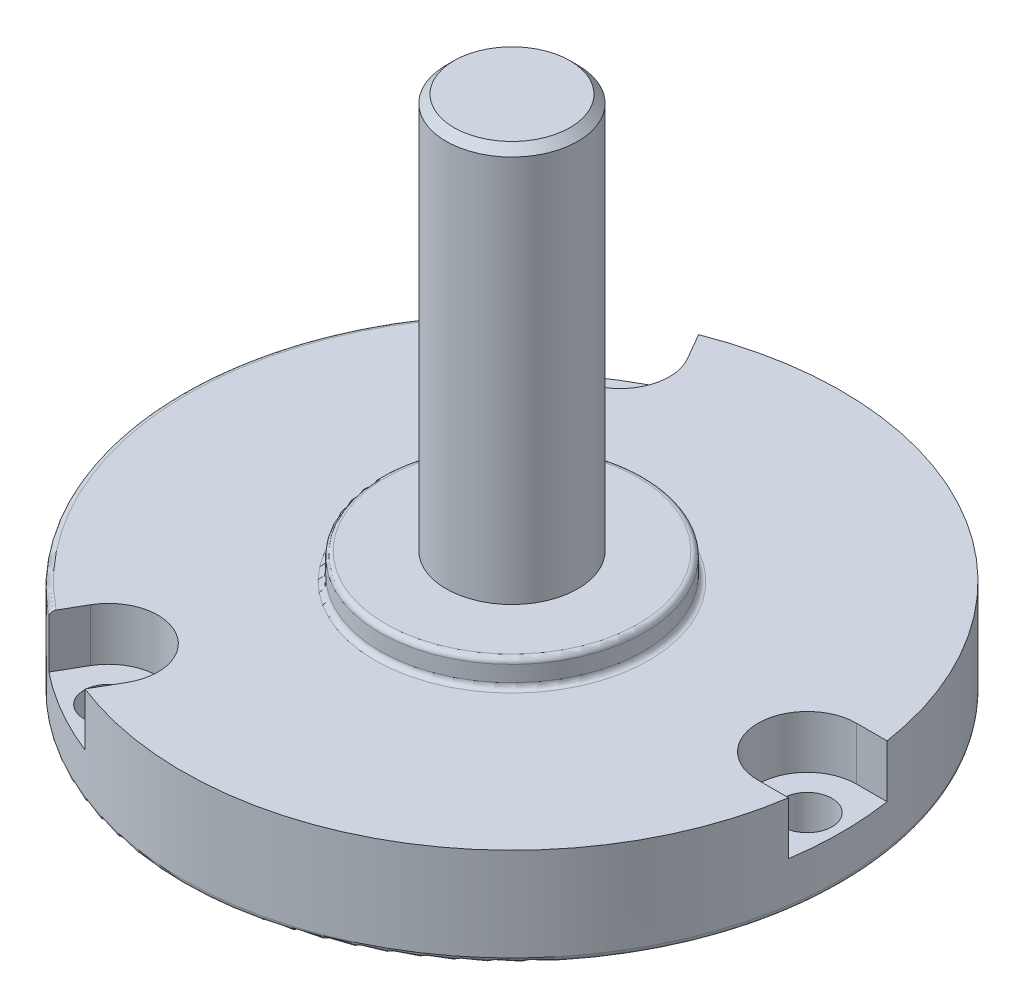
from build123d import *

# Parameters (mm, degrees)
SKETCH1_R          = 15.875
EXTRUDE1_DEPTH     = 4.7498
SKETCH2_R          = 6.35
EXTRUDE2_DEPTH     = 1.27
SKETCH3_R          = 11.684
CUT_EXTRUDE1_DEPTH = 0.762
CUT_EXTRUDE2_START = -2.54
CUT_EXTRUDE2_DEPTH = 2.54
CIRPATTERN1_COUNT  = 3
SKETCH19_R         = 3.175
EXTRUDE5_DEPTH     = 19.05
CHAMFER6_SIZE      = 0.381
FILLET1_R          = 0.254
FILLET2_R          = 0.254


with BuildPart() as part:
    # Sketch1 → Extrude1 (new body)
    with BuildSketch(Plane(origin=(0, 0, 0), x_dir=(1, 0, 0), z_dir=(0, 1, 0))):
        with Locations(Location((0, 0, 0), (0, 0, 270))):
            Circle(SKETCH1_R)
    extrude(amount=EXTRUDE1_DEPTH)

    # Sketch2 → Extrude2 (add)
    with BuildSketch(Plane(origin=(0, 4.7498, 0), x_dir=(-1, 0, 0), z_dir=(0, 1, 0))):
        with Locations(Location((0, 0, 0), (0, 0, 90))):
            Circle(SKETCH2_R)
    extrude(amount=EXTRUDE2_DEPTH)

    # Sketch3 → Cut-Extrude1 (cut)
    with BuildSketch(Plane.XZ):
        with Locations(Location((0, 0, 0), (0, 0, 270))):
            Circle(SKETCH3_R)
    extrude(amount=-CUT_EXTRUDE1_DEPTH, mode=Mode.SUBTRACT)

    # Sketch16 → 3_32 _0.09375_ Diameter Hole1 (revolve, cut)
    with BuildSketch(Plane(origin=(14.224, 0, 0), x_dir=(0, 0, -1), z_dir=(1, 0, 0))):
        Polygon((0, 0), (0, 7.065399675), (1.190625, 6.35), (1.190625, 0), align=None)
    f_3_32_0_09375_diameter_hole1 = revolve(axis=Axis((14.224, -6.35, 0), (0, 1, 0)), mode=Mode.SUBTRACT)

    # Sketch23 → Cut-Extrude2 (cut)
    with BuildSketch(Plane(origin=(0, 4.7498, 0), x_dir=(-1, 0, 0), z_dir=(0, 1, 0)).offset(CUT_EXTRUDE2_START)):
        with BuildLine():
            Line((-14.224, 2.3749), (-15.696352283, 2.3749))
            ThreePointArc((-15.696352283, 2.3749), (-15.875, 0), (-15.696352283, -2.3749))
            Line((-15.696352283, -2.3749), (-14.224, -2.3749))
            ThreePointArc((-14.224, -2.3749), (-11.8491, 0), (-14.224, 2.3749))
        make_face()
    cut_extrude2 = extrude(amount=CUT_EXTRUDE2_DEPTH, mode=Mode.SUBTRACT)

    # CirPattern1: 3_32 _0.09375_ Diameter Hole1, Cut-Extrude2 ×3 about axis
    cirpattern1_axis = Axis((0, 0, 0), (0, 1, 0))
    add([f_3_32_0_09375_diameter_hole1.rotate(cirpattern1_axis, i * 360 / CIRPATTERN1_COUNT) for i in range(1, CIRPATTERN1_COUNT)], mode=Mode.SUBTRACT)
    add([cut_extrude2.rotate(cirpattern1_axis, i * 360 / CIRPATTERN1_COUNT) for i in range(1, CIRPATTERN1_COUNT)], mode=Mode.SUBTRACT)

    # Sketch19 → Extrude5 (add)
    with BuildSketch(Plane(origin=(0, 6.0198, 0), x_dir=(-1, 0, 0), z_dir=(0, 1, 0))):
        with Locations(Location((0, 0, 0), (0, 0, 270))):
            Circle(SKETCH19_R)
    extrude(amount=EXTRUDE5_DEPTH)

    # Chamfer6
    chamfer6_edges = [part.edges().sort_by_distance(p)[0] for p in [
        (0, 25.0698, 3.175),
    ]]
    chamfer(chamfer6_edges, length=CHAMFER6_SIZE)

    # Fillet1
    fillet1_edges = [part.edges().sort_by_distance(p)[0] for p in [
        (0, 0.762, 11.684),
        (0, 0, 11.684),
        (0, 0, -15.875),
        (-15.875, 4.7498, 0),
    ]]
    fillet(fillet1_edges, radius=FILLET1_R)

    # Fillet2
    fillet2_edges = [part.edges().sort_by_distance(p)[0] for p in [
        (0, 4.7498, -6.35),
        (0, 6.0198, -6.35),
    ]]
    fillet(fillet2_edges, radius=FILLET2_R)


solid = part.part
